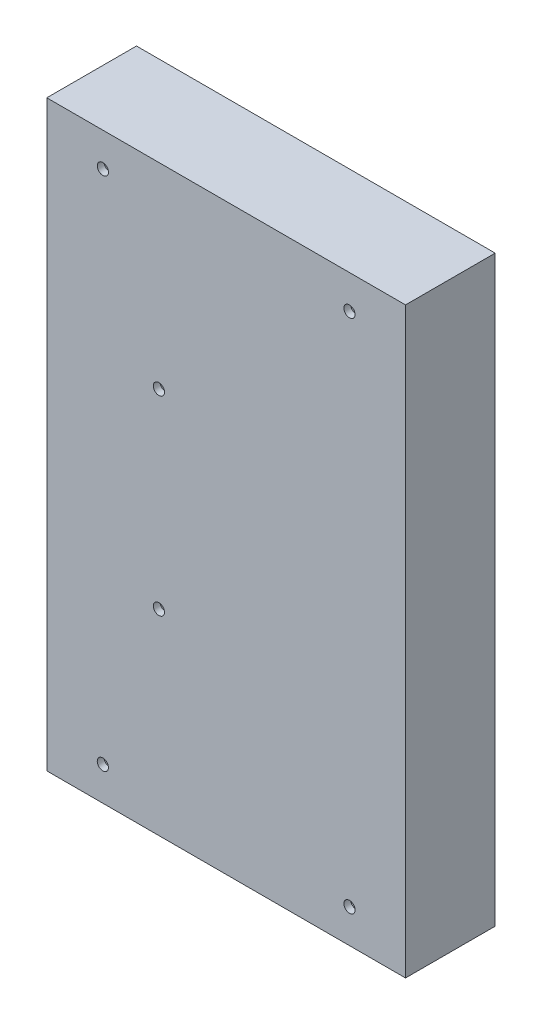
from build123d import *

# Parameters (mm, degrees)
CROQUIS1_W              = 150
CROQUIS1_H              = 250
CROQUIS1_R              = 19.5
SALIENTE_EXTRUIR1_DEPTH = 10
CROQUIS3_W              = 160
CROQUIS3_H              = 260
CROQUIS3_W_2            = 150
CROQUIS3_H_2            = 250
SALIENTE_EXTRUIR2_DEPTH = 25
SALIENTE_EXTRUIR3_DEPTH = 15
CROQUIS6_W              = 160
CROQUIS6_H              = 260
CROQUIS6_W_2            = 150
CROQUIS6_H_2            = 250
SALIENTE_EXTRUIR4_DEPTH = 15
CROQUIS7_W              = 160
CROQUIS7_H              = 260
SALIENTE_EXTRUIR5_DEPTH = 5
CROQUIS8_R              = 2.5
CORTAR_EXTRUIR1_DEPTH   = 3
CROQUIS9_R              = 2.5
CORTAR_EXTRUIR2_DEPTH   = 3


with BuildPart() as part:
    # Croquis1 → Saliente-Extruir1 (new body)
    with BuildSketch(Plane.XY):
        Rectangle(CROQUIS1_W, CROQUIS1_H)
        with Locations((-50, 100)):
            Circle(CROQUIS1_R, mode=Mode.SUBTRACT)
        with Locations((-50, 40)):
            Circle(CROQUIS1_R, mode=Mode.SUBTRACT)
        with Locations((-50, -20)):
            Circle(CROQUIS1_R, mode=Mode.SUBTRACT)
        with Locations(Location((50, -20, 0), (0, 0, 180))):
            Circle(CROQUIS1_R, mode=Mode.SUBTRACT)
        with Locations(Location((50, 40, 0), (0, 0, 180))):
            Circle(CROQUIS1_R, mode=Mode.SUBTRACT)
        with Locations(Location((50, 100, 0), (0, 0, 180))):
            Circle(CROQUIS1_R, mode=Mode.SUBTRACT)
        with Locations((-30, -100)):
            Circle(CROQUIS1_R, mode=Mode.SUBTRACT)
        with Locations(Location((30, -100, 0), (0, 0, 180))):
            Circle(CROQUIS1_R, mode=Mode.SUBTRACT)
        with Locations((0, -40)):
            Circle(CROQUIS1_R, mode=Mode.SUBTRACT)
    extrude(amount=SALIENTE_EXTRUIR1_DEPTH)

    # Croquis3 → Saliente-Extruir2 (add)
    with BuildSketch(Plane.XY.offset(10)):
        Rectangle(CROQUIS3_W, CROQUIS3_H)
        Rectangle(CROQUIS3_W_2, CROQUIS3_H_2, mode=Mode.SUBTRACT)
    extrude(amount=-SALIENTE_EXTRUIR2_DEPTH)

    # Croquis4 → Saliente-Extruir3 (add)
    with BuildSketch(Plane(origin=(0, 0, 0), x_dir=(-1, 0, 0), z_dir=(0, 0, -1))):
        Polygon((-5, 125), (-5, 5), (-75, -115), (-75, -125), (-3.830215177, -2.994654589), (3.830215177, -2.994654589), (75, -125), (75, -115), (4.127714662, 6.495346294), (5, 125), align=None)
    extrude(amount=SALIENTE_EXTRUIR3_DEPTH)

    # Croquis6 → Saliente-Extruir4 (add)
    with BuildSketch(Plane.XY.offset(10)):
        Rectangle(CROQUIS6_W, CROQUIS6_H)
        Rectangle(CROQUIS6_W_2, CROQUIS6_H_2, mode=Mode.SUBTRACT)
    extrude(amount=SALIENTE_EXTRUIR4_DEPTH)

    # Croquis7 → Saliente-Extruir5 (add)
    with BuildSketch(Plane.XY.offset(25)):
        Rectangle(CROQUIS7_W, CROQUIS7_H)
    extrude(amount=-SALIENTE_EXTRUIR5_DEPTH)

    # Croquis8 → Cortar-Extruir1 (cut)
    with BuildSketch(Plane.XY.offset(25)):
        with Locations((-30, 42.5)):
            Circle(CROQUIS8_R)
        with Locations(Location((-30, -42.5, 0), (0, 0, 180))):
            Circle(CROQUIS8_R)
    extrude(amount=-CORTAR_EXTRUIR1_DEPTH, mode=Mode.SUBTRACT)

    # Croquis9 → Cortar-Extruir2 (cut)
    with BuildSketch(Plane.XY.offset(25)):
        with Locations((-55, 115)):
            Circle(CROQUIS9_R)
        with Locations(Location((55, 115, 0), (0, 0, 180))):
            Circle(CROQUIS9_R)
        with Locations((55, -115)):
            Circle(CROQUIS9_R)
        with Locations(Location((-55, -115, 0), (0, 0, 180))):
            Circle(CROQUIS9_R)
    extrude(amount=-CORTAR_EXTRUIR2_DEPTH, mode=Mode.SUBTRACT)


solid = part.part
